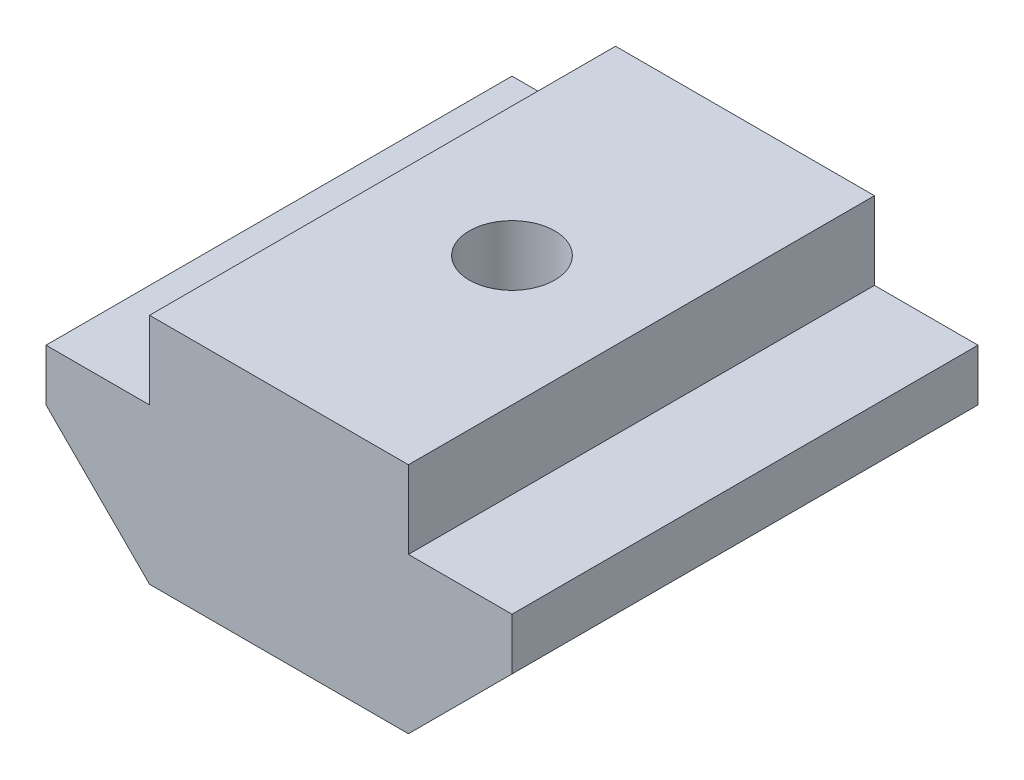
ISO-10303-21;
HEADER;
FILE_DESCRIPTION(('STEP AP214'),'2;1');
FILE_NAME('part.step','',(''),(''),'','','');
FILE_SCHEMA(('AUTOMOTIVE_DESIGN { 1 0 10303 214 1 1 1 1 }'));
ENDSEC;
DATA;
#1=APPLICATION_CONTEXT('core data for automotive mechanical design processes');
#2=APPLICATION_PROTOCOL_DEFINITION('international standard','automotive_design',2000,#1);
#3=PRODUCT_CONTEXT('',#1,'mechanical');
#4=PRODUCT('Part','Part','',(#3));
#5=PRODUCT_RELATED_PRODUCT_CATEGORY('part','',(#4));
#6=PRODUCT_DEFINITION_FORMATION('','',#4);
#7=PRODUCT_DEFINITION_CONTEXT('part definition',#1,'design');
#8=PRODUCT_DEFINITION('design','',#6,#7);
#9=PRODUCT_DEFINITION_SHAPE('','',#8);
#10=(LENGTH_UNIT() NAMED_UNIT(*) SI_UNIT(.MILLI.,.METRE.));
#11=(NAMED_UNIT(*) PLANE_ANGLE_UNIT() SI_UNIT($,.RADIAN.));
#12=(NAMED_UNIT(*) SI_UNIT($,.STERADIAN.) SOLID_ANGLE_UNIT());
#13=UNCERTAINTY_MEASURE_WITH_UNIT(LENGTH_MEASURE(1.E-05),#10,'distance_accuracy_value','');
#14=(GEOMETRIC_REPRESENTATION_CONTEXT(3) GLOBAL_UNCERTAINTY_ASSIGNED_CONTEXT((#13)) GLOBAL_UNIT_ASSIGNED_CONTEXT((#10,
#11,#12)) REPRESENTATION_CONTEXT('',''));
#15=CARTESIAN_POINT('',(0.,0.,0.));
#16=DIRECTION('',(0.,0.,1.));
#17=DIRECTION('',(1.,0.,0.));
#18=AXIS2_PLACEMENT_3D('',#15,#16,#17);
#19=CARTESIAN_POINT('',(0.,-2.,18.));
#20=DIRECTION('',(1.,0.,0.));
#21=DIRECTION('',(0.,0.,-1.));
#22=AXIS2_PLACEMENT_3D('',#19,#20,#21);
#23=PLANE('',#22);
#24=DIRECTION('',(0.,-1.,0.));
#25=VECTOR('',#24,1.);
#26=CARTESIAN_POINT('',(0.,-2.,0.));
#27=LINE('',#26,#25);
#28=CARTESIAN_POINT('',(0.,0.,0.));
#29=VERTEX_POINT('',#28);
#30=CARTESIAN_POINT('',(0.,-2.,0.));
#31=VERTEX_POINT('',#30);
#32=EDGE_CURVE('E153',#29,#31,#27,.T.);
#33=ORIENTED_EDGE('',*,*,#32,.T.);
#34=DIRECTION('',(0.,0.,-1.));
#35=VECTOR('',#34,1.);
#36=CARTESIAN_POINT('',(0.,-2.,18.));
#37=LINE('',#36,#35);
#38=CARTESIAN_POINT('',(0.,-2.,18.));
#39=VERTEX_POINT('',#38);
#40=EDGE_CURVE('E11',#39,#31,#37,.T.);
#41=ORIENTED_EDGE('',*,*,#40,.F.);
#42=DIRECTION('',(0.,-1.,0.));
#43=VECTOR('',#42,1.);
#44=CARTESIAN_POINT('',(0.,-2.,18.));
#45=LINE('',#44,#43);
#46=CARTESIAN_POINT('',(0.,0.,18.));
#47=VERTEX_POINT('',#46);
#48=EDGE_CURVE('E175',#47,#39,#45,.T.);
#49=ORIENTED_EDGE('',*,*,#48,.F.);
#50=DIRECTION('',(0.,0.,-1.));
#51=VECTOR('',#50,1.);
#52=CARTESIAN_POINT('',(0.,0.,18.));
#53=LINE('',#52,#51);
#54=EDGE_CURVE('E149',#47,#29,#53,.T.);
#55=ORIENTED_EDGE('',*,*,#54,.T.);
#56=EDGE_LOOP('',(#33,#41,#49,#55));
#57=FACE_BOUND('',#56,.T.);
#58=ADVANCED_FACE('F44',(#57),#23,.F.);
#59=CARTESIAN_POINT('',(4.,-6.,18.));
#60=DIRECTION('',(0.707106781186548,0.707106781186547,0.));
#61=DIRECTION('',(-0.707106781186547,0.707106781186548,0.));
#62=AXIS2_PLACEMENT_3D('',#59,#60,#61);
#63=PLANE('',#62);
#64=DIRECTION('',(0.707106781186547,-0.707106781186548,0.));
#65=VECTOR('',#64,1.);
#66=CARTESIAN_POINT('',(4.,-6.,0.));
#67=LINE('',#66,#65);
#68=CARTESIAN_POINT('',(4.,-6.,0.));
#69=VERTEX_POINT('',#68);
#70=EDGE_CURVE('E156',#31,#69,#67,.T.);
#71=ORIENTED_EDGE('',*,*,#70,.T.);
#72=DIRECTION('',(0.,0.,-1.));
#73=VECTOR('',#72,1.);
#74=CARTESIAN_POINT('',(4.,-6.,18.));
#75=LINE('',#74,#73);
#76=CARTESIAN_POINT('',(4.,-6.,18.));
#77=VERTEX_POINT('',#76);
#78=EDGE_CURVE('E52',#77,#69,#75,.T.);
#79=ORIENTED_EDGE('',*,*,#78,.F.);
#80=DIRECTION('',(0.707106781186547,-0.707106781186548,0.));
#81=VECTOR('',#80,1.);
#82=CARTESIAN_POINT('',(4.,-6.,18.));
#83=LINE('',#82,#81);
#84=EDGE_CURVE('E109',#39,#77,#83,.T.);
#85=ORIENTED_EDGE('',*,*,#84,.F.);
#86=ORIENTED_EDGE('',*,*,#40,.T.);
#87=EDGE_LOOP('',(#71,#79,#85,#86));
#88=FACE_BOUND('',#87,.T.);
#89=ADVANCED_FACE('F250',(#88),#63,.F.);
#90=CARTESIAN_POINT('',(14.,-6.,18.));
#91=DIRECTION('',(0.,1.,0.));
#92=DIRECTION('',(-1.,0.,0.));
#93=AXIS2_PLACEMENT_3D('',#90,#91,#92);
#94=PLANE('',#93);
#95=CARTESIAN_POINT('',(9.,-6.,9.));
#96=DIRECTION('',(0.,1.,0.));
#97=DIRECTION('',(0.,0.,1.));
#98=AXIS2_PLACEMENT_3D('',#95,#96,#97);
#99=CIRCLE('',#98,1.65);
#100=CARTESIAN_POINT('',(9.,-6.,10.65));
#101=VERTEX_POINT('',#100);
#102=EDGE_CURVE('E222',#101,#101,#99,.T.);
#103=ORIENTED_EDGE('',*,*,#102,.T.);
#104=EDGE_LOOP('',(#103));
#105=FACE_BOUND('',#104,.T.);
#106=DIRECTION('',(1.,0.,0.));
#107=VECTOR('',#106,1.);
#108=CARTESIAN_POINT('',(14.,-6.,0.));
#109=LINE('',#108,#107);
#110=CARTESIAN_POINT('',(14.,-6.,0.));
#111=VERTEX_POINT('',#110);
#112=EDGE_CURVE('E157',#69,#111,#109,.T.);
#113=ORIENTED_EDGE('',*,*,#112,.T.);
#114=DIRECTION('',(0.,0.,-1.));
#115=VECTOR('',#114,1.);
#116=CARTESIAN_POINT('',(14.,-6.,18.));
#117=LINE('',#116,#115);
#118=CARTESIAN_POINT('',(14.,-6.,18.));
#119=VERTEX_POINT('',#118);
#120=EDGE_CURVE('E183',#119,#111,#117,.T.);
#121=ORIENTED_EDGE('',*,*,#120,.F.);
#122=DIRECTION('',(1.,0.,0.));
#123=VECTOR('',#122,1.);
#124=CARTESIAN_POINT('',(14.,-6.,18.));
#125=LINE('',#124,#123);
#126=EDGE_CURVE('E191',#77,#119,#125,.T.);
#127=ORIENTED_EDGE('',*,*,#126,.F.);
#128=ORIENTED_EDGE('',*,*,#78,.T.);
#129=EDGE_LOOP('',(#113,#121,#127,#128));
#130=FACE_BOUND('',#129,.T.);
#131=ADVANCED_FACE('F193',(#105,#130),#94,.F.);
#132=CARTESIAN_POINT('',(18.,-2.,18.));
#133=DIRECTION('',(-0.707106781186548,0.707106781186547,0.));
#134=DIRECTION('',(-0.707106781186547,-0.707106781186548,0.));
#135=AXIS2_PLACEMENT_3D('',#132,#133,#134);
#136=PLANE('',#135);
#137=DIRECTION('',(0.707106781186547,0.707106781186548,0.));
#138=VECTOR('',#137,1.);
#139=CARTESIAN_POINT('',(18.,-2.,0.));
#140=LINE('',#139,#138);
#141=CARTESIAN_POINT('',(18.,-2.,0.));
#142=VERTEX_POINT('',#141);
#143=EDGE_CURVE('E161',#111,#142,#140,.T.);
#144=ORIENTED_EDGE('',*,*,#143,.T.);
#145=DIRECTION('',(0.,0.,-1.));
#146=VECTOR('',#145,1.);
#147=CARTESIAN_POINT('',(18.,-2.,18.));
#148=LINE('',#147,#146);
#149=CARTESIAN_POINT('',(18.,-2.,18.));
#150=VERTEX_POINT('',#149);
#151=EDGE_CURVE('E185',#150,#142,#148,.T.);
#152=ORIENTED_EDGE('',*,*,#151,.F.);
#153=DIRECTION('',(0.707106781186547,0.707106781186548,0.));
#154=VECTOR('',#153,1.);
#155=CARTESIAN_POINT('',(18.,-2.,18.));
#156=LINE('',#155,#154);
#157=EDGE_CURVE('E211',#119,#150,#156,.T.);
#158=ORIENTED_EDGE('',*,*,#157,.F.);
#159=ORIENTED_EDGE('',*,*,#120,.T.);
#160=EDGE_LOOP('',(#144,#152,#158,#159));
#161=FACE_BOUND('',#160,.T.);
#162=ADVANCED_FACE('F205',(#161),#136,.F.);
#163=CARTESIAN_POINT('',(18.,0.,18.));
#164=DIRECTION('',(-1.,0.,0.));
#165=DIRECTION('',(0.,0.,1.));
#166=AXIS2_PLACEMENT_3D('',#163,#164,#165);
#167=PLANE('',#166);
#168=DIRECTION('',(0.,1.,0.));
#169=VECTOR('',#168,1.);
#170=CARTESIAN_POINT('',(18.,0.,0.));
#171=LINE('',#170,#169);
#172=CARTESIAN_POINT('',(18.,0.,0.));
#173=VERTEX_POINT('',#172);
#174=EDGE_CURVE('E162',#142,#173,#171,.T.);
#175=ORIENTED_EDGE('',*,*,#174,.T.);
#176=DIRECTION('',(0.,0.,-1.));
#177=VECTOR('',#176,1.);
#178=CARTESIAN_POINT('',(18.,0.,18.));
#179=LINE('',#178,#177);
#180=CARTESIAN_POINT('',(18.,0.,18.));
#181=VERTEX_POINT('',#180);
#182=EDGE_CURVE('E177',#181,#173,#179,.T.);
#183=ORIENTED_EDGE('',*,*,#182,.F.);
#184=DIRECTION('',(0.,1.,0.));
#185=VECTOR('',#184,1.);
#186=CARTESIAN_POINT('',(18.,0.,18.));
#187=LINE('',#186,#185);
#188=EDGE_CURVE('E208',#150,#181,#187,.T.);
#189=ORIENTED_EDGE('',*,*,#188,.F.);
#190=ORIENTED_EDGE('',*,*,#151,.T.);
#191=EDGE_LOOP('',(#175,#183,#189,#190));
#192=FACE_BOUND('',#191,.T.);
#193=ADVANCED_FACE('F206',(#192),#167,.F.);
#194=CARTESIAN_POINT('',(14.,0.,18.));
#195=DIRECTION('',(0.,-1.,0.));
#196=DIRECTION('',(0.,0.,-1.));
#197=AXIS2_PLACEMENT_3D('',#194,#195,#196);
#198=PLANE('',#197);
#199=DIRECTION('',(-1.,0.,0.));
#200=VECTOR('',#199,1.);
#201=CARTESIAN_POINT('',(14.,0.,0.));
#202=LINE('',#201,#200);
#203=CARTESIAN_POINT('',(14.,0.,0.));
#204=VERTEX_POINT('',#203);
#205=EDGE_CURVE('E164',#173,#204,#202,.T.);
#206=ORIENTED_EDGE('',*,*,#205,.T.);
#207=DIRECTION('',(0.,0.,-1.));
#208=VECTOR('',#207,1.);
#209=CARTESIAN_POINT('',(14.,0.,18.));
#210=LINE('',#209,#208);
#211=CARTESIAN_POINT('',(14.,0.,18.));
#212=VERTEX_POINT('',#211);
#213=EDGE_CURVE('E178',#212,#204,#210,.T.);
#214=ORIENTED_EDGE('',*,*,#213,.F.);
#215=DIRECTION('',(-1.,0.,0.));
#216=VECTOR('',#215,1.);
#217=CARTESIAN_POINT('',(14.,0.,18.));
#218=LINE('',#217,#216);
#219=EDGE_CURVE('E209',#181,#212,#218,.T.);
#220=ORIENTED_EDGE('',*,*,#219,.F.);
#221=ORIENTED_EDGE('',*,*,#182,.T.);
#222=EDGE_LOOP('',(#206,#214,#220,#221));
#223=FACE_BOUND('',#222,.T.);
#224=ADVANCED_FACE('F241',(#223),#198,.F.);
#225=CARTESIAN_POINT('',(14.,3.,18.));
#226=DIRECTION('',(-1.,0.,0.));
#227=DIRECTION('',(0.,-1.,0.));
#228=AXIS2_PLACEMENT_3D('',#225,#226,#227);
#229=PLANE('',#228);
#230=DIRECTION('',(0.,1.,0.));
#231=VECTOR('',#230,1.);
#232=CARTESIAN_POINT('',(14.,3.,0.));
#233=LINE('',#232,#231);
#234=CARTESIAN_POINT('',(14.,3.,0.));
#235=VERTEX_POINT('',#234);
#236=EDGE_CURVE('E170',#204,#235,#233,.T.);
#237=ORIENTED_EDGE('',*,*,#236,.T.);
#238=DIRECTION('',(0.,0.,-1.));
#239=VECTOR('',#238,1.);
#240=CARTESIAN_POINT('',(14.,3.,18.));
#241=LINE('',#240,#239);
#242=CARTESIAN_POINT('',(14.,3.,18.));
#243=VERTEX_POINT('',#242);
#244=EDGE_CURVE('E145',#243,#235,#241,.T.);
#245=ORIENTED_EDGE('',*,*,#244,.F.);
#246=DIRECTION('',(0.,1.,0.));
#247=VECTOR('',#246,1.);
#248=CARTESIAN_POINT('',(14.,3.,18.));
#249=LINE('',#248,#247);
#250=EDGE_CURVE('E132',#212,#243,#249,.T.);
#251=ORIENTED_EDGE('',*,*,#250,.F.);
#252=ORIENTED_EDGE('',*,*,#213,.T.);
#253=EDGE_LOOP('',(#237,#245,#251,#252));
#254=FACE_BOUND('',#253,.T.);
#255=ADVANCED_FACE('F231',(#254),#229,.F.);
#256=CARTESIAN_POINT('',(4.,3.,18.));
#257=DIRECTION('',(0.,-1.,0.));
#258=DIRECTION('',(0.,0.,-1.));
#259=AXIS2_PLACEMENT_3D('',#256,#257,#258);
#260=PLANE('',#259);
#261=CARTESIAN_POINT('',(9.,3.,9.));
#262=DIRECTION('',(0.,1.,0.));
#263=DIRECTION('',(0.,0.,1.));
#264=AXIS2_PLACEMENT_3D('',#261,#262,#263);
#265=CIRCLE('',#264,1.64999999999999);
#266=CARTESIAN_POINT('',(9.,3.,10.65));
#267=VERTEX_POINT('',#266);
#268=EDGE_CURVE('E160',#267,#267,#265,.T.);
#269=ORIENTED_EDGE('',*,*,#268,.F.);
#270=EDGE_LOOP('',(#269));
#271=FACE_BOUND('',#270,.T.);
#272=DIRECTION('',(-1.,0.,0.));
#273=VECTOR('',#272,1.);
#274=CARTESIAN_POINT('',(4.,3.,0.));
#275=LINE('',#274,#273);
#276=CARTESIAN_POINT('',(4.,3.,0.));
#277=VERTEX_POINT('',#276);
#278=EDGE_CURVE('E141',#235,#277,#275,.T.);
#279=ORIENTED_EDGE('',*,*,#278,.T.);
#280=DIRECTION('',(0.,0.,-1.));
#281=VECTOR('',#280,1.);
#282=CARTESIAN_POINT('',(4.,3.,18.));
#283=LINE('',#282,#281);
#284=CARTESIAN_POINT('',(4.,3.,18.));
#285=VERTEX_POINT('',#284);
#286=EDGE_CURVE('E139',#285,#277,#283,.T.);
#287=ORIENTED_EDGE('',*,*,#286,.F.);
#288=DIRECTION('',(-1.,0.,0.));
#289=VECTOR('',#288,1.);
#290=CARTESIAN_POINT('',(4.,3.,18.));
#291=LINE('',#290,#289);
#292=EDGE_CURVE('E129',#243,#285,#291,.T.);
#293=ORIENTED_EDGE('',*,*,#292,.F.);
#294=ORIENTED_EDGE('',*,*,#244,.T.);
#295=EDGE_LOOP('',(#279,#287,#293,#294));
#296=FACE_BOUND('',#295,.T.);
#297=ADVANCED_FACE('F143',(#271,#296),#260,.F.);
#298=CARTESIAN_POINT('',(4.,0.,18.));
#299=DIRECTION('',(1.,0.,0.));
#300=DIRECTION('',(0.,0.,-1.));
#301=AXIS2_PLACEMENT_3D('',#298,#299,#300);
#302=PLANE('',#301);
#303=DIRECTION('',(0.,-1.,0.));
#304=VECTOR('',#303,1.);
#305=CARTESIAN_POINT('',(4.,0.,0.));
#306=LINE('',#305,#304);
#307=CARTESIAN_POINT('',(4.,0.,0.));
#308=VERTEX_POINT('',#307);
#309=EDGE_CURVE('E96',#277,#308,#306,.T.);
#310=ORIENTED_EDGE('',*,*,#309,.T.);
#311=DIRECTION('',(0.,0.,-1.));
#312=VECTOR('',#311,1.);
#313=CARTESIAN_POINT('',(4.,0.,18.));
#314=LINE('',#313,#312);
#315=CARTESIAN_POINT('',(4.,0.,18.));
#316=VERTEX_POINT('',#315);
#317=EDGE_CURVE('E144',#316,#308,#314,.T.);
#318=ORIENTED_EDGE('',*,*,#317,.F.);
#319=DIRECTION('',(0.,-1.,0.));
#320=VECTOR('',#319,1.);
#321=CARTESIAN_POINT('',(4.,0.,18.));
#322=LINE('',#321,#320);
#323=EDGE_CURVE('E131',#285,#316,#322,.T.);
#324=ORIENTED_EDGE('',*,*,#323,.F.);
#325=ORIENTED_EDGE('',*,*,#286,.T.);
#326=EDGE_LOOP('',(#310,#318,#324,#325));
#327=FACE_BOUND('',#326,.T.);
#328=ADVANCED_FACE('F150',(#327),#302,.F.);
#329=CARTESIAN_POINT('',(0.,0.,18.));
#330=DIRECTION('',(0.,-1.,0.));
#331=DIRECTION('',(0.,0.,-1.));
#332=AXIS2_PLACEMENT_3D('',#329,#330,#331);
#333=PLANE('',#332);
#334=DIRECTION('',(-1.,0.,0.));
#335=VECTOR('',#334,1.);
#336=CARTESIAN_POINT('',(0.,0.,0.));
#337=LINE('',#336,#335);
#338=EDGE_CURVE('E105',#308,#29,#337,.T.);
#339=ORIENTED_EDGE('',*,*,#338,.T.);
#340=ORIENTED_EDGE('',*,*,#54,.F.);
#341=DIRECTION('',(-1.,0.,0.));
#342=VECTOR('',#341,1.);
#343=CARTESIAN_POINT('',(0.,0.,18.));
#344=LINE('',#343,#342);
#345=EDGE_CURVE('E63',#316,#47,#344,.T.);
#346=ORIENTED_EDGE('',*,*,#345,.F.);
#347=ORIENTED_EDGE('',*,*,#317,.T.);
#348=EDGE_LOOP('',(#339,#340,#346,#347));
#349=FACE_BOUND('',#348,.T.);
#350=ADVANCED_FACE('F238',(#349),#333,.F.);
#351=CARTESIAN_POINT('',(0.,0.,18.));
#352=DIRECTION('',(0.,0.,-1.));
#353=DIRECTION('',(-1.,0.,0.));
#354=AXIS2_PLACEMENT_3D('',#351,#352,#353);
#355=PLANE('',#354);
#356=ORIENTED_EDGE('',*,*,#48,.T.);
#357=ORIENTED_EDGE('',*,*,#84,.T.);
#358=ORIENTED_EDGE('',*,*,#126,.T.);
#359=ORIENTED_EDGE('',*,*,#157,.T.);
#360=ORIENTED_EDGE('',*,*,#188,.T.);
#361=ORIENTED_EDGE('',*,*,#219,.T.);
#362=ORIENTED_EDGE('',*,*,#250,.T.);
#363=ORIENTED_EDGE('',*,*,#292,.T.);
#364=ORIENTED_EDGE('',*,*,#323,.T.);
#365=ORIENTED_EDGE('',*,*,#345,.T.);
#366=EDGE_LOOP('',(#356,#357,#358,#359,#360,#361,#362,#363,#364,#365));
#367=FACE_BOUND('',#366,.T.);
#368=ADVANCED_FACE('F133',(#367),#355,.F.);
#369=CARTESIAN_POINT('',(0.,0.,0.));
#370=DIRECTION('',(0.,0.,-1.));
#371=DIRECTION('',(-1.,0.,0.));
#372=AXIS2_PLACEMENT_3D('',#369,#370,#371);
#373=PLANE('',#372);
#374=ORIENTED_EDGE('',*,*,#32,.F.);
#375=ORIENTED_EDGE('',*,*,#338,.F.);
#376=ORIENTED_EDGE('',*,*,#309,.F.);
#377=ORIENTED_EDGE('',*,*,#278,.F.);
#378=ORIENTED_EDGE('',*,*,#236,.F.);
#379=ORIENTED_EDGE('',*,*,#205,.F.);
#380=ORIENTED_EDGE('',*,*,#174,.F.);
#381=ORIENTED_EDGE('',*,*,#143,.F.);
#382=ORIENTED_EDGE('',*,*,#112,.F.);
#383=ORIENTED_EDGE('',*,*,#70,.F.);
#384=EDGE_LOOP('',(#374,#375,#376,#377,#378,#379,#380,#381,#382,#383));
#385=FACE_BOUND('',#384,.T.);
#386=ADVANCED_FACE('F197',(#385),#373,.T.);
#387=CARTESIAN_POINT('',(9.,3.,9.));
#388=DIRECTION('',(0.,1.,0.));
#389=DIRECTION('',(0.,0.,1.));
#390=AXIS2_PLACEMENT_3D('',#387,#388,#389);
#391=CYLINDRICAL_SURFACE('',#390,1.64999999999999);
#392=ORIENTED_EDGE('',*,*,#102,.F.);
#393=EDGE_LOOP('',(#392));
#394=FACE_BOUND('',#393,.T.);
#395=ORIENTED_EDGE('',*,*,#268,.T.);
#396=EDGE_LOOP('',(#395));
#397=FACE_BOUND('',#396,.T.);
#398=ADVANCED_FACE('F228',(#394,#397),#391,.F.);
#399=CLOSED_SHELL('',(#58,#89,#131,#162,#193,#224,#255,#297,#328,#350,#368,#386,#398));
#400=MANIFOLD_SOLID_BREP('B2',#399);
#401=ADVANCED_BREP_SHAPE_REPRESENTATION('',(#18,#400),#14);
#402=SHAPE_DEFINITION_REPRESENTATION(#9,#401);
ENDSEC;
END-ISO-10303-21;
